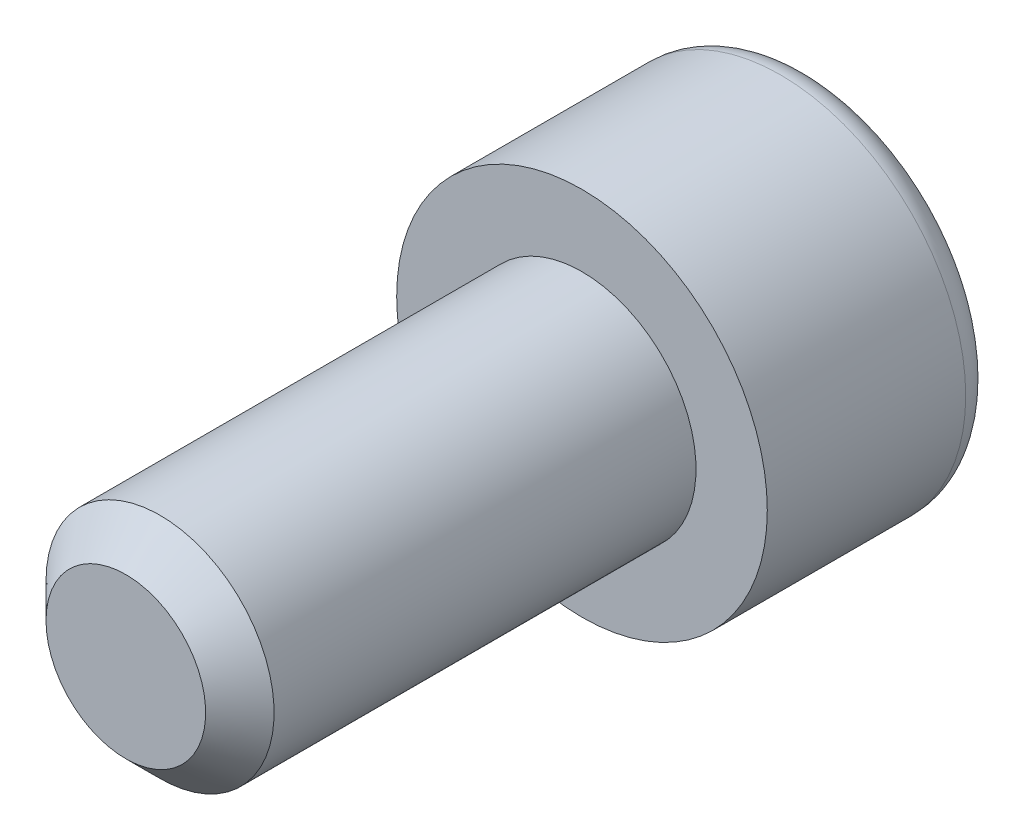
ISO-10303-21;
HEADER;
FILE_DESCRIPTION(('STEP AP214'),'2;1');
FILE_NAME('part.step','',(''),(''),'','','');
FILE_SCHEMA(('AUTOMOTIVE_DESIGN { 1 0 10303 214 1 1 1 1 }'));
ENDSEC;
DATA;
#1=APPLICATION_CONTEXT('core data for automotive mechanical design processes');
#2=APPLICATION_PROTOCOL_DEFINITION('international standard','automotive_design',2000,#1);
#3=PRODUCT_CONTEXT('',#1,'mechanical');
#4=PRODUCT('Part','Part','',(#3));
#5=PRODUCT_RELATED_PRODUCT_CATEGORY('part','',(#4));
#6=PRODUCT_DEFINITION_FORMATION('','',#4);
#7=PRODUCT_DEFINITION_CONTEXT('part definition',#1,'design');
#8=PRODUCT_DEFINITION('design','',#6,#7);
#9=PRODUCT_DEFINITION_SHAPE('','',#8);
#10=(LENGTH_UNIT() NAMED_UNIT(*) SI_UNIT(.MILLI.,.METRE.));
#11=(NAMED_UNIT(*) PLANE_ANGLE_UNIT() SI_UNIT($,.RADIAN.));
#12=(NAMED_UNIT(*) SI_UNIT($,.STERADIAN.) SOLID_ANGLE_UNIT());
#13=UNCERTAINTY_MEASURE_WITH_UNIT(LENGTH_MEASURE(1.E-05),#10,'distance_accuracy_value','');
#14=(GEOMETRIC_REPRESENTATION_CONTEXT(3) GLOBAL_UNCERTAINTY_ASSIGNED_CONTEXT((#13)) GLOBAL_UNIT_ASSIGNED_CONTEXT((#10,
#11,#12)) REPRESENTATION_CONTEXT('',''));
#15=CARTESIAN_POINT('',(0.,0.,0.));
#16=DIRECTION('',(0.,0.,1.));
#17=DIRECTION('',(1.,0.,0.));
#18=AXIS2_PLACEMENT_3D('',#15,#16,#17);
#19=CARTESIAN_POINT('',(0.,0.,-7.99999999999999));
#20=DIRECTION('',(0.,0.,1.));
#21=DIRECTION('',(1.,0.,0.));
#22=AXIS2_PLACEMENT_3D('',#19,#20,#21);
#23=PLANE('',#22);
#24=CARTESIAN_POINT('',(0.,0.,-7.99999999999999));
#25=DIRECTION('',(0.,0.,1.));
#26=DIRECTION('',(1.,0.,0.));
#27=AXIS2_PLACEMENT_3D('',#24,#25,#26);
#28=CIRCLE('',#27,5.46);
#29=CARTESIAN_POINT('',(5.46000000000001,0.,-7.99999999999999));
#30=VERTEX_POINT('',#29);
#31=EDGE_CURVE('E11',#30,#30,#28,.F.);
#32=ORIENTED_EDGE('',*,*,#31,.T.);
#33=EDGE_LOOP('',(#32));
#34=FACE_BOUND('',#33,.T.);
#35=DIRECTION('',(0.86602540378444,-0.5,0.));
#36=VECTOR('',#35,1.);
#37=CARTESIAN_POINT('',(-2.99999999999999,-1.73205080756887,-7.99999999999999));
#38=LINE('',#37,#36);
#39=CARTESIAN_POINT('',(-2.99999999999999,-1.73205080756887,-7.99999999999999));
#40=VERTEX_POINT('',#39);
#41=CARTESIAN_POINT('',(0.,-3.46410161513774,-7.99999999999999));
#42=VERTEX_POINT('',#41);
#43=EDGE_CURVE('E47',#40,#42,#38,.T.);
#44=ORIENTED_EDGE('',*,*,#43,.T.);
#45=DIRECTION('',(0.86602540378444,0.500000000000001,0.));
#46=VECTOR('',#45,1.);
#47=CARTESIAN_POINT('',(0.,-3.46410161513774,-7.99999999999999));
#48=LINE('',#47,#46);
#49=CARTESIAN_POINT('',(3.00000000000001,-1.73205080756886,-7.99999999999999));
#50=VERTEX_POINT('',#49);
#51=EDGE_CURVE('E87',#42,#50,#48,.T.);
#52=ORIENTED_EDGE('',*,*,#51,.T.);
#53=DIRECTION('',(0.,1.,0.));
#54=VECTOR('',#53,1.);
#55=CARTESIAN_POINT('',(3.00000000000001,-1.73205080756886,-7.99999999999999));
#56=LINE('',#55,#54);
#57=CARTESIAN_POINT('',(3.00000000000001,1.73205080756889,-7.99999999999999));
#58=VERTEX_POINT('',#57);
#59=EDGE_CURVE('E95',#50,#58,#56,.T.);
#60=ORIENTED_EDGE('',*,*,#59,.T.);
#61=DIRECTION('',(-0.86602540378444,0.5,0.));
#62=VECTOR('',#61,1.);
#63=CARTESIAN_POINT('',(3.00000000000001,1.73205080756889,-7.99999999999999));
#64=LINE('',#63,#62);
#65=CARTESIAN_POINT('',(0.,3.46410161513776,-7.99999999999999));
#66=VERTEX_POINT('',#65);
#67=EDGE_CURVE('E110',#58,#66,#64,.T.);
#68=ORIENTED_EDGE('',*,*,#67,.T.);
#69=DIRECTION('',(-0.86602540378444,-0.500000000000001,0.));
#70=VECTOR('',#69,1.);
#71=CARTESIAN_POINT('',(0.,3.46410161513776,-7.99999999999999));
#72=LINE('',#71,#70);
#73=CARTESIAN_POINT('',(-2.99999999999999,1.73205080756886,-7.99999999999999));
#74=VERTEX_POINT('',#73);
#75=EDGE_CURVE('E113',#66,#74,#72,.T.);
#76=ORIENTED_EDGE('',*,*,#75,.T.);
#77=DIRECTION('',(0.,-1.,0.));
#78=VECTOR('',#77,1.);
#79=CARTESIAN_POINT('',(-2.99999999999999,1.73205080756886,-7.99999999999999));
#80=LINE('',#79,#78);
#81=EDGE_CURVE('E106',#74,#40,#80,.T.);
#82=ORIENTED_EDGE('',*,*,#81,.T.);
#83=EDGE_LOOP('',(#44,#52,#60,#68,#76,#82));
#84=FACE_BOUND('',#83,.T.);
#85=ADVANCED_FACE('F32',(#34,#84),#23,.F.);
#86=CARTESIAN_POINT('',(0.,0.,16.));
#87=DIRECTION('',(0.,0.,-1.));
#88=DIRECTION('',(-1.,0.,0.));
#89=AXIS2_PLACEMENT_3D('',#86,#87,#88);
#90=CYLINDRICAL_SURFACE('',#89,4.);
#91=CARTESIAN_POINT('',(0.,0.,14.8));
#92=DIRECTION('',(0.,0.,0.999999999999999));
#93=DIRECTION('',(1.,0.,0.));
#94=AXIS2_PLACEMENT_3D('',#91,#92,#93);
#95=CIRCLE('',#94,4.);
#96=CARTESIAN_POINT('',(-4.00000000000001,0.,14.8));
#97=VERTEX_POINT('',#96);
#98=EDGE_CURVE('E143',#97,#97,#95,.F.);
#99=CARTESIAN_POINT('',(0.,0.,0.));
#100=DIRECTION('',(0.,0.,1.));
#101=DIRECTION('',(1.,0.,0.));
#102=AXIS2_PLACEMENT_3D('',#99,#100,#101);
#103=CIRCLE('',#102,4.);
#104=CARTESIAN_POINT('',(-4.00000000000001,0.,0.));
#105=VERTEX_POINT('',#104);
#106=EDGE_CURVE('E137',#105,#105,#103,.T.);
#107=CARTESIAN_POINT('',(-4.00000000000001,0.,14.8));
#108=CARTESIAN_POINT('',(-4.00000000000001,0.,14.6458333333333));
#109=CARTESIAN_POINT('',(-4.00000000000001,0.,14.4916666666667));
#110=CARTESIAN_POINT('',(-4.00000000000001,0.,14.1833333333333));
#111=CARTESIAN_POINT('',(-4.00000000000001,0.,14.0291666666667));
#112=CARTESIAN_POINT('',(-4.00000000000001,0.,13.7208333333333));
#113=CARTESIAN_POINT('',(-4.00000000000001,0.,13.5666666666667));
#114=CARTESIAN_POINT('',(-4.00000000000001,0.,13.2583333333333));
#115=CARTESIAN_POINT('',(-4.00000000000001,0.,13.1041666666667));
#116=CARTESIAN_POINT('',(-4.00000000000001,0.,12.7958333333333));
#117=CARTESIAN_POINT('',(-4.00000000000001,0.,12.6416666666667));
#118=CARTESIAN_POINT('',(-4.00000000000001,0.,12.3333333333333));
#119=CARTESIAN_POINT('',(-4.00000000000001,0.,12.1791666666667));
#120=CARTESIAN_POINT('',(-4.00000000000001,0.,11.8708333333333));
#121=CARTESIAN_POINT('',(-4.00000000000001,0.,11.7166666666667));
#122=CARTESIAN_POINT('',(-4.00000000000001,0.,11.4083333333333));
#123=CARTESIAN_POINT('',(-4.00000000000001,0.,11.2541666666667));
#124=CARTESIAN_POINT('',(-4.00000000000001,0.,10.9458333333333));
#125=CARTESIAN_POINT('',(-4.00000000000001,0.,10.7916666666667));
#126=CARTESIAN_POINT('',(-4.00000000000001,0.,10.4833333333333));
#127=CARTESIAN_POINT('',(-4.00000000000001,0.,10.3291666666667));
#128=CARTESIAN_POINT('',(-4.00000000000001,0.,10.0208333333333));
#129=CARTESIAN_POINT('',(-4.00000000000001,0.,9.86666666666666));
#130=CARTESIAN_POINT('',(-4.00000000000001,0.,9.55833333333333));
#131=CARTESIAN_POINT('',(-4.00000000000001,0.,9.40416666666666));
#132=CARTESIAN_POINT('',(-4.00000000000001,0.,9.09583333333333));
#133=CARTESIAN_POINT('',(-4.00000000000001,0.,8.94166666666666));
#134=CARTESIAN_POINT('',(-4.00000000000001,0.,8.63333333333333));
#135=CARTESIAN_POINT('',(-4.00000000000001,0.,8.47916666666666));
#136=CARTESIAN_POINT('',(-4.00000000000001,0.,8.17083333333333));
#137=CARTESIAN_POINT('',(-4.00000000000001,0.,8.01666666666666));
#138=CARTESIAN_POINT('',(-4.00000000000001,0.,7.70833333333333));
#139=CARTESIAN_POINT('',(-4.00000000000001,0.,7.55416666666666));
#140=CARTESIAN_POINT('',(-4.00000000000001,0.,7.24583333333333));
#141=CARTESIAN_POINT('',(-4.00000000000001,0.,7.09166666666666));
#142=CARTESIAN_POINT('',(-4.00000000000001,0.,6.78333333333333));
#143=CARTESIAN_POINT('',(-4.00000000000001,0.,6.62916666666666));
#144=CARTESIAN_POINT('',(-4.00000000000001,0.,6.32083333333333));
#145=CARTESIAN_POINT('',(-4.00000000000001,0.,6.16666666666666));
#146=CARTESIAN_POINT('',(-4.00000000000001,0.,5.85833333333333));
#147=CARTESIAN_POINT('',(-4.00000000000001,0.,5.70416666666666));
#148=CARTESIAN_POINT('',(-4.00000000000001,0.,5.39583333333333));
#149=CARTESIAN_POINT('',(-4.00000000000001,0.,5.24166666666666));
#150=CARTESIAN_POINT('',(-4.00000000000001,0.,4.93333333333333));
#151=CARTESIAN_POINT('',(-4.00000000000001,0.,4.77916666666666));
#152=CARTESIAN_POINT('',(-4.00000000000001,0.,4.47083333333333));
#153=CARTESIAN_POINT('',(-4.00000000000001,0.,4.31666666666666));
#154=CARTESIAN_POINT('',(-4.00000000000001,0.,4.00833333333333));
#155=CARTESIAN_POINT('',(-4.00000000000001,0.,3.85416666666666));
#156=CARTESIAN_POINT('',(-4.00000000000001,0.,3.54583333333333));
#157=CARTESIAN_POINT('',(-4.00000000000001,0.,3.39166666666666));
#158=CARTESIAN_POINT('',(-4.00000000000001,0.,3.08333333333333));
#159=CARTESIAN_POINT('',(-4.00000000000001,0.,2.92916666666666));
#160=CARTESIAN_POINT('',(-4.00000000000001,0.,2.62083333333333));
#161=CARTESIAN_POINT('',(-4.00000000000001,0.,2.46666666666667));
#162=CARTESIAN_POINT('',(-4.00000000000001,0.,2.15833333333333));
#163=CARTESIAN_POINT('',(-4.00000000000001,0.,2.00416666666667));
#164=CARTESIAN_POINT('',(-4.00000000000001,0.,1.69583333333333));
#165=CARTESIAN_POINT('',(-4.00000000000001,0.,1.54166666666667));
#166=CARTESIAN_POINT('',(-4.00000000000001,0.,1.23333333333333));
#167=CARTESIAN_POINT('',(-4.00000000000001,0.,1.07916666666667));
#168=CARTESIAN_POINT('',(-4.00000000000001,0.,0.770833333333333));
#169=CARTESIAN_POINT('',(-4.00000000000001,0.,0.616666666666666));
#170=CARTESIAN_POINT('',(-4.00000000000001,0.,0.308333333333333));
#171=CARTESIAN_POINT('',(-4.00000000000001,0.,0.154166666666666));
#172=CARTESIAN_POINT('',(-4.00000000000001,0.,0.));
#173=B_SPLINE_CURVE_WITH_KNOTS('',3,(#107,#108,#109,#110,#111,#112,#113,#114,#115,#116,#117,
#118,#119,#120,#121,#122,#123,#124,#125,#126,#127,#128,#129,#130,#131,#132,#133,#134,#135,#136,
#137,#138,#139,#140,#141,#142,#143,#144,#145,#146,#147,#148,#149,#150,#151,#152,#153,#154,#155,
#156,#157,#158,#159,#160,#161,#162,#163,#164,#165,#166,#167,#168,#169,#170,#171,#172),
.UNSPECIFIED.,.F.,.F.,(4,2,2,2,2,2,2,2,2,2,2,2,2,2,2,2,2,2,2,2,2,2,2,2,2,2,2,2,2,2,2,2,4),(0.,
0.462499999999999,0.924999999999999,1.3875,1.85,2.3125,2.775,3.2375,3.69999999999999,4.1625,
4.625,5.0875,5.55,6.01249999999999,6.47499999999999,6.93749999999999,7.4,7.86249999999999,8.325,
8.78749999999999,9.24999999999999,9.71249999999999,10.175,10.6375,11.1,11.5625,12.025,12.4875,
12.95,13.4125,13.875,14.3375,14.8),.UNSPECIFIED.);
#174=EDGE_CURVE('BSEAM34',#97,#105,#173,.T.);
#175=ORIENTED_EDGE('',*,*,#98,.T.);
#176=ORIENTED_EDGE('',*,*,#106,.T.);
#177=ORIENTED_EDGE('',*,*,#174,.T.);
#178=ORIENTED_EDGE('',*,*,#174,.F.);
#179=EDGE_LOOP('',(#175,#177,#176,#178));
#180=FACE_BOUND('',#179,.T.);
#181=ADVANCED_FACE('F34',(#180),#90,.T.);
#182=CARTESIAN_POINT('',(0.,0.,16.));
#183=DIRECTION('',(0.,0.,1.));
#184=DIRECTION('',(1.,0.,0.));
#185=AXIS2_PLACEMENT_3D('',#182,#183,#184);
#186=PLANE('',#185);
#187=CARTESIAN_POINT('',(0.,0.,16.));
#188=DIRECTION('',(0.,0.,1.));
#189=DIRECTION('',(1.,0.,0.));
#190=AXIS2_PLACEMENT_3D('',#187,#188,#189);
#191=CIRCLE('',#190,2.8);
#192=CARTESIAN_POINT('',(-2.80000000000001,0.,16.));
#193=VERTEX_POINT('',#192);
#194=EDGE_CURVE('E140',#193,#193,#191,.T.);
#195=ORIENTED_EDGE('',*,*,#194,.T.);
#196=EDGE_LOOP('',(#195));
#197=FACE_BOUND('',#196,.T.);
#198=ADVANCED_FACE('F169',(#197),#186,.T.);
#199=CARTESIAN_POINT('',(0.,0.,0.));
#200=DIRECTION('',(0.,0.,1.));
#201=DIRECTION('',(1.,0.,0.));
#202=AXIS2_PLACEMENT_3D('',#199,#200,#201);
#203=PLANE('',#202);
#204=CARTESIAN_POINT('',(0.,0.,0.));
#205=DIRECTION('',(0.,0.,1.));
#206=DIRECTION('',(1.,0.,0.));
#207=AXIS2_PLACEMENT_3D('',#204,#205,#206);
#208=CIRCLE('',#207,6.5);
#209=CARTESIAN_POINT('',(6.50000000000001,0.,0.));
#210=VERTEX_POINT('',#209);
#211=EDGE_CURVE('E101',#210,#210,#208,.T.);
#212=ORIENTED_EDGE('',*,*,#211,.T.);
#213=EDGE_LOOP('',(#212));
#214=FACE_BOUND('',#213,.T.);
#215=ORIENTED_EDGE('',*,*,#106,.F.);
#216=EDGE_LOOP('',(#215));
#217=FACE_BOUND('',#216,.T.);
#218=ADVANCED_FACE('F173',(#214,#217),#203,.T.);
#219=CARTESIAN_POINT('',(0.,0.,-7.99999999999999));
#220=DIRECTION('',(0.,0.,1.));
#221=DIRECTION('',(1.,0.,0.));
#222=AXIS2_PLACEMENT_3D('',#219,#220,#221);
#223=CYLINDRICAL_SURFACE('',#222,6.5);
#224=CARTESIAN_POINT('',(0.,0.,-6.96));
#225=DIRECTION('',(0.,0.,1.));
#226=DIRECTION('',(1.,0.,0.));
#227=AXIS2_PLACEMENT_3D('',#224,#225,#226);
#228=CIRCLE('',#227,6.5);
#229=CARTESIAN_POINT('',(6.50000000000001,0.,-6.96));
#230=VERTEX_POINT('',#229);
#231=EDGE_CURVE('E40',#230,#230,#228,.T.);
#232=CARTESIAN_POINT('',(6.50000000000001,0.,-6.96));
#233=CARTESIAN_POINT('',(6.50000000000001,0.,-6.8875));
#234=CARTESIAN_POINT('',(6.50000000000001,0.,-6.815));
#235=CARTESIAN_POINT('',(6.50000000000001,0.,-6.67));
#236=CARTESIAN_POINT('',(6.50000000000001,0.,-6.5975));
#237=CARTESIAN_POINT('',(6.50000000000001,0.,-6.4525));
#238=CARTESIAN_POINT('',(6.50000000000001,0.,-6.38));
#239=CARTESIAN_POINT('',(6.50000000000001,0.,-6.235));
#240=CARTESIAN_POINT('',(6.50000000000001,0.,-6.1625));
#241=CARTESIAN_POINT('',(6.50000000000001,0.,-6.0175));
#242=CARTESIAN_POINT('',(6.50000000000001,0.,-5.945));
#243=CARTESIAN_POINT('',(6.50000000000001,0.,-5.8));
#244=CARTESIAN_POINT('',(6.50000000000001,0.,-5.7275));
#245=CARTESIAN_POINT('',(6.50000000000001,0.,-5.5825));
#246=CARTESIAN_POINT('',(6.50000000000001,0.,-5.51));
#247=CARTESIAN_POINT('',(6.50000000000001,0.,-5.365));
#248=CARTESIAN_POINT('',(6.50000000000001,0.,-5.2925));
#249=CARTESIAN_POINT('',(6.50000000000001,0.,-5.1475));
#250=CARTESIAN_POINT('',(6.50000000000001,0.,-5.075));
#251=CARTESIAN_POINT('',(6.50000000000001,0.,-4.93));
#252=CARTESIAN_POINT('',(6.50000000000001,0.,-4.8575));
#253=CARTESIAN_POINT('',(6.50000000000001,0.,-4.7125));
#254=CARTESIAN_POINT('',(6.50000000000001,0.,-4.64));
#255=CARTESIAN_POINT('',(6.50000000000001,0.,-4.495));
#256=CARTESIAN_POINT('',(6.50000000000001,0.,-4.4225));
#257=CARTESIAN_POINT('',(6.50000000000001,0.,-4.2775));
#258=CARTESIAN_POINT('',(6.50000000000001,0.,-4.205));
#259=CARTESIAN_POINT('',(6.50000000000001,0.,-4.06));
#260=CARTESIAN_POINT('',(6.50000000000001,0.,-3.9875));
#261=CARTESIAN_POINT('',(6.50000000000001,0.,-3.8425));
#262=CARTESIAN_POINT('',(6.50000000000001,0.,-3.77));
#263=CARTESIAN_POINT('',(6.50000000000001,0.,-3.625));
#264=CARTESIAN_POINT('',(6.50000000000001,0.,-3.5525));
#265=CARTESIAN_POINT('',(6.50000000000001,0.,-3.4075));
#266=CARTESIAN_POINT('',(6.50000000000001,0.,-3.335));
#267=CARTESIAN_POINT('',(6.50000000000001,0.,-3.19));
#268=CARTESIAN_POINT('',(6.50000000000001,0.,-3.1175));
#269=CARTESIAN_POINT('',(6.50000000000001,0.,-2.9725));
#270=CARTESIAN_POINT('',(6.50000000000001,0.,-2.9));
#271=CARTESIAN_POINT('',(6.50000000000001,0.,-2.755));
#272=CARTESIAN_POINT('',(6.50000000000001,0.,-2.6825));
#273=CARTESIAN_POINT('',(6.50000000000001,0.,-2.5375));
#274=CARTESIAN_POINT('',(6.50000000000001,0.,-2.465));
#275=CARTESIAN_POINT('',(6.50000000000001,0.,-2.32));
#276=CARTESIAN_POINT('',(6.50000000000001,0.,-2.2475));
#277=CARTESIAN_POINT('',(6.50000000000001,0.,-2.1025));
#278=CARTESIAN_POINT('',(6.50000000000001,0.,-2.03));
#279=CARTESIAN_POINT('',(6.50000000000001,0.,-1.885));
#280=CARTESIAN_POINT('',(6.50000000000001,0.,-1.8125));
#281=CARTESIAN_POINT('',(6.50000000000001,0.,-1.6675));
#282=CARTESIAN_POINT('',(6.50000000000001,0.,-1.595));
#283=CARTESIAN_POINT('',(6.50000000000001,0.,-1.45));
#284=CARTESIAN_POINT('',(6.50000000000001,0.,-1.3775));
#285=CARTESIAN_POINT('',(6.50000000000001,0.,-1.2325));
#286=CARTESIAN_POINT('',(6.50000000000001,0.,-1.16));
#287=CARTESIAN_POINT('',(6.50000000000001,0.,-1.015));
#288=CARTESIAN_POINT('',(6.50000000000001,0.,-0.9425));
#289=CARTESIAN_POINT('',(6.50000000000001,0.,-0.7975));
#290=CARTESIAN_POINT('',(6.50000000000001,0.,-0.725));
#291=CARTESIAN_POINT('',(6.50000000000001,0.,-0.58));
#292=CARTESIAN_POINT('',(6.50000000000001,0.,-0.5075));
#293=CARTESIAN_POINT('',(6.50000000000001,0.,-0.3625));
#294=CARTESIAN_POINT('',(6.50000000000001,0.,-0.29));
#295=CARTESIAN_POINT('',(6.50000000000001,0.,-0.145));
#296=CARTESIAN_POINT('',(6.50000000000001,0.,-0.0724999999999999));
#297=CARTESIAN_POINT('',(6.50000000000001,0.,0.));
#298=B_SPLINE_CURVE_WITH_KNOTS('',3,(#232,#233,#234,#235,#236,#237,#238,#239,#240,#241,#242,
#243,#244,#245,#246,#247,#248,#249,#250,#251,#252,#253,#254,#255,#256,#257,#258,#259,#260,#261,
#262,#263,#264,#265,#266,#267,#268,#269,#270,#271,#272,#273,#274,#275,#276,#277,#278,#279,#280,
#281,#282,#283,#284,#285,#286,#287,#288,#289,#290,#291,#292,#293,#294,#295,#296,#297),
.UNSPECIFIED.,.F.,.F.,(4,2,2,2,2,2,2,2,2,2,2,2,2,2,2,2,2,2,2,2,2,2,2,2,2,2,2,2,2,2,2,2,4),(0.,
0.217500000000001,0.435,0.6525,0.87,1.0875,1.305,1.5225,1.74,1.9575,2.175,2.3925,2.61,2.8275,
3.045,3.2625,3.48,3.6975,3.915,4.1325,4.35,4.5675,4.785,5.0025,5.22,5.4375,5.655,5.8725,6.09,
6.3075,6.525,6.7425,6.96),.UNSPECIFIED.);
#299=EDGE_CURVE('BSEAM148',#230,#210,#298,.T.);
#300=ORIENTED_EDGE('',*,*,#231,.T.);
#301=ORIENTED_EDGE('',*,*,#211,.F.);
#302=ORIENTED_EDGE('',*,*,#299,.T.);
#303=ORIENTED_EDGE('',*,*,#299,.F.);
#304=EDGE_LOOP('',(#300,#302,#301,#303));
#305=FACE_BOUND('',#304,.T.);
#306=ADVANCED_FACE('F148',(#305),#223,.T.);
#307=CARTESIAN_POINT('',(-2.99999999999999,-1.73205080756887,-2.4));
#308=DIRECTION('',(0.500000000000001,0.86602540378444,0.));
#309=DIRECTION('',(-0.86602540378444,0.5,0.));
#310=AXIS2_PLACEMENT_3D('',#307,#308,#309);
#311=PLANE('',#310);
#312=ORIENTED_EDGE('',*,*,#43,.F.);
#313=DIRECTION('',(0.,0.,-1.));
#314=VECTOR('',#313,1.);
#315=CARTESIAN_POINT('',(-2.99999999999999,-1.73205080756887,-2.4));
#316=LINE('',#315,#314);
#317=CARTESIAN_POINT('',(-2.99999999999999,-1.73205080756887,-2.4));
#318=VERTEX_POINT('',#317);
#319=EDGE_CURVE('E126',#318,#40,#316,.T.);
#320=ORIENTED_EDGE('',*,*,#319,.F.);
#321=DIRECTION('',(0.86602540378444,-0.5,0.));
#322=VECTOR('',#321,1.);
#323=CARTESIAN_POINT('',(-2.99999999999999,-1.73205080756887,-2.4));
#324=LINE('',#323,#322);
#325=CARTESIAN_POINT('',(0.,-3.46410161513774,-2.4));
#326=VERTEX_POINT('',#325);
#327=EDGE_CURVE('E100',#318,#326,#324,.T.);
#328=ORIENTED_EDGE('',*,*,#327,.T.);
#329=DIRECTION('',(0.,0.,-1.));
#330=VECTOR('',#329,1.);
#331=CARTESIAN_POINT('',(0.,-3.46410161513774,-2.4));
#332=LINE('',#331,#330);
#333=EDGE_CURVE('E89',#326,#42,#332,.T.);
#334=ORIENTED_EDGE('',*,*,#333,.T.);
#335=EDGE_LOOP('',(#312,#320,#328,#334));
#336=FACE_BOUND('',#335,.T.);
#337=ADVANCED_FACE('F98',(#336),#311,.T.);
#338=CARTESIAN_POINT('',(0.,-3.46410161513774,-2.4));
#339=DIRECTION('',(-0.5,0.866025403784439,0.));
#340=DIRECTION('',(-0.86602540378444,-0.500000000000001,0.));
#341=AXIS2_PLACEMENT_3D('',#338,#339,#340);
#342=PLANE('',#341);
#343=ORIENTED_EDGE('',*,*,#51,.F.);
#344=ORIENTED_EDGE('',*,*,#333,.F.);
#345=DIRECTION('',(0.86602540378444,0.500000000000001,0.));
#346=VECTOR('',#345,1.);
#347=CARTESIAN_POINT('',(0.,-3.46410161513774,-2.4));
#348=LINE('',#347,#346);
#349=CARTESIAN_POINT('',(3.00000000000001,-1.73205080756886,-2.4));
#350=VERTEX_POINT('',#349);
#351=EDGE_CURVE('E117',#326,#350,#348,.T.);
#352=ORIENTED_EDGE('',*,*,#351,.T.);
#353=DIRECTION('',(0.,0.,-1.));
#354=VECTOR('',#353,1.);
#355=CARTESIAN_POINT('',(3.00000000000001,-1.73205080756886,-2.4));
#356=LINE('',#355,#354);
#357=EDGE_CURVE('E91',#350,#50,#356,.T.);
#358=ORIENTED_EDGE('',*,*,#357,.T.);
#359=EDGE_LOOP('',(#343,#344,#352,#358));
#360=FACE_BOUND('',#359,.T.);
#361=ADVANCED_FACE('F88',(#360),#342,.T.);
#362=CARTESIAN_POINT('',(3.00000000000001,-1.73205080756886,-2.4));
#363=DIRECTION('',(-1.,0.,0.));
#364=DIRECTION('',(0.,0.,1.));
#365=AXIS2_PLACEMENT_3D('',#362,#363,#364);
#366=PLANE('',#365);
#367=ORIENTED_EDGE('',*,*,#59,.F.);
#368=ORIENTED_EDGE('',*,*,#357,.F.);
#369=DIRECTION('',(0.,1.,0.));
#370=VECTOR('',#369,1.);
#371=CARTESIAN_POINT('',(3.00000000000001,-1.73205080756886,-2.4));
#372=LINE('',#371,#370);
#373=CARTESIAN_POINT('',(3.00000000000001,1.73205080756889,-2.4));
#374=VERTEX_POINT('',#373);
#375=EDGE_CURVE('E119',#350,#374,#372,.T.);
#376=ORIENTED_EDGE('',*,*,#375,.T.);
#377=DIRECTION('',(0.,0.,-1.));
#378=VECTOR('',#377,1.);
#379=CARTESIAN_POINT('',(3.00000000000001,1.73205080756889,-2.4));
#380=LINE('',#379,#378);
#381=EDGE_CURVE('E132',#374,#58,#380,.T.);
#382=ORIENTED_EDGE('',*,*,#381,.T.);
#383=EDGE_LOOP('',(#367,#368,#376,#382));
#384=FACE_BOUND('',#383,.T.);
#385=ADVANCED_FACE('F205',(#384),#366,.T.);
#386=CARTESIAN_POINT('',(3.00000000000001,1.73205080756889,-2.4));
#387=DIRECTION('',(-0.500000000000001,-0.86602540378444,0.));
#388=DIRECTION('',(0.86602540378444,-0.5,0.));
#389=AXIS2_PLACEMENT_3D('',#386,#387,#388);
#390=PLANE('',#389);
#391=ORIENTED_EDGE('',*,*,#67,.F.);
#392=ORIENTED_EDGE('',*,*,#381,.F.);
#393=DIRECTION('',(-0.86602540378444,0.5,0.));
#394=VECTOR('',#393,1.);
#395=CARTESIAN_POINT('',(3.00000000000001,1.73205080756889,-2.4));
#396=LINE('',#395,#394);
#397=CARTESIAN_POINT('',(0.,3.46410161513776,-2.4));
#398=VERTEX_POINT('',#397);
#399=EDGE_CURVE('E121',#374,#398,#396,.T.);
#400=ORIENTED_EDGE('',*,*,#399,.T.);
#401=DIRECTION('',(0.,0.,-1.));
#402=VECTOR('',#401,1.);
#403=CARTESIAN_POINT('',(0.,3.46410161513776,-2.4));
#404=LINE('',#403,#402);
#405=EDGE_CURVE('E130',#398,#66,#404,.T.);
#406=ORIENTED_EDGE('',*,*,#405,.T.);
#407=EDGE_LOOP('',(#391,#392,#400,#406));
#408=FACE_BOUND('',#407,.T.);
#409=ADVANCED_FACE('F212',(#408),#390,.T.);
#410=CARTESIAN_POINT('',(0.,3.46410161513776,-2.4));
#411=DIRECTION('',(0.5,-0.866025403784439,0.));
#412=DIRECTION('',(0.86602540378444,0.500000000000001,0.));
#413=AXIS2_PLACEMENT_3D('',#410,#411,#412);
#414=PLANE('',#413);
#415=ORIENTED_EDGE('',*,*,#75,.F.);
#416=ORIENTED_EDGE('',*,*,#405,.F.);
#417=DIRECTION('',(-0.86602540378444,-0.500000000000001,0.));
#418=VECTOR('',#417,1.);
#419=CARTESIAN_POINT('',(0.,3.46410161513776,-2.4));
#420=LINE('',#419,#418);
#421=CARTESIAN_POINT('',(-2.99999999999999,1.73205080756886,-2.4));
#422=VERTEX_POINT('',#421);
#423=EDGE_CURVE('E123',#398,#422,#420,.T.);
#424=ORIENTED_EDGE('',*,*,#423,.T.);
#425=DIRECTION('',(0.,0.,-1.));
#426=VECTOR('',#425,1.);
#427=CARTESIAN_POINT('',(-2.99999999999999,1.73205080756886,-2.4));
#428=LINE('',#427,#426);
#429=EDGE_CURVE('E128',#422,#74,#428,.T.);
#430=ORIENTED_EDGE('',*,*,#429,.T.);
#431=EDGE_LOOP('',(#415,#416,#424,#430));
#432=FACE_BOUND('',#431,.T.);
#433=ADVANCED_FACE('F220',(#432),#414,.T.);
#434=CARTESIAN_POINT('',(-2.99999999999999,1.73205080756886,-2.4));
#435=DIRECTION('',(1.,0.,0.));
#436=DIRECTION('',(0.,1.,0.));
#437=AXIS2_PLACEMENT_3D('',#434,#435,#436);
#438=PLANE('',#437);
#439=ORIENTED_EDGE('',*,*,#81,.F.);
#440=ORIENTED_EDGE('',*,*,#429,.F.);
#441=DIRECTION('',(0.,-1.,0.));
#442=VECTOR('',#441,1.);
#443=CARTESIAN_POINT('',(-2.99999999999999,1.73205080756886,-2.4));
#444=LINE('',#443,#442);
#445=EDGE_CURVE('E54',#422,#318,#444,.T.);
#446=ORIENTED_EDGE('',*,*,#445,.T.);
#447=ORIENTED_EDGE('',*,*,#319,.T.);
#448=EDGE_LOOP('',(#439,#440,#446,#447));
#449=FACE_BOUND('',#448,.T.);
#450=ADVANCED_FACE('F228',(#449),#438,.T.);
#451=CARTESIAN_POINT('',(-2.99999999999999,-1.73205080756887,-2.4));
#452=DIRECTION('',(0.,0.,-1.));
#453=DIRECTION('',(-1.,0.,0.));
#454=AXIS2_PLACEMENT_3D('',#451,#452,#453);
#455=PLANE('',#454);
#456=ORIENTED_EDGE('',*,*,#327,.F.);
#457=ORIENTED_EDGE('',*,*,#445,.F.);
#458=ORIENTED_EDGE('',*,*,#423,.F.);
#459=ORIENTED_EDGE('',*,*,#399,.F.);
#460=ORIENTED_EDGE('',*,*,#375,.F.);
#461=ORIENTED_EDGE('',*,*,#351,.F.);
#462=EDGE_LOOP('',(#456,#457,#458,#459,#460,#461));
#463=FACE_BOUND('',#462,.T.);
#464=ADVANCED_FACE('F159',(#463),#455,.T.);
#465=CARTESIAN_POINT('',(0.,0.,16.));
#466=DIRECTION('',(0.,0.,-0.999999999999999));
#467=DIRECTION('',(-1.,0.,0.));
#468=AXIS2_PLACEMENT_3D('',#465,#466,#467);
#469=CONICAL_SURFACE('',#468,2.8,0.785398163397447);
#470=CARTESIAN_POINT('',(-4.,0.,14.8));
#471=CARTESIAN_POINT('',(-3.9875,0.,14.8125));
#472=CARTESIAN_POINT('',(-3.975,0.,14.825));
#473=CARTESIAN_POINT('',(-3.95,0.,14.85));
#474=CARTESIAN_POINT('',(-3.9375,0.,14.8625));
#475=CARTESIAN_POINT('',(-3.9125,0.,14.8875));
#476=CARTESIAN_POINT('',(-3.9,0.,14.9));
#477=CARTESIAN_POINT('',(-3.875,0.,14.925));
#478=CARTESIAN_POINT('',(-3.8625,0.,14.9375));
#479=CARTESIAN_POINT('',(-3.8375,0.,14.9625));
#480=CARTESIAN_POINT('',(-3.825,0.,14.975));
#481=CARTESIAN_POINT('',(-3.8,0.,15.));
#482=CARTESIAN_POINT('',(-3.7875,0.,15.0125));
#483=CARTESIAN_POINT('',(-3.7625,0.,15.0375));
#484=CARTESIAN_POINT('',(-3.75,0.,15.05));
#485=CARTESIAN_POINT('',(-3.725,0.,15.075));
#486=CARTESIAN_POINT('',(-3.7125,0.,15.0875));
#487=CARTESIAN_POINT('',(-3.6875,0.,15.1125));
#488=CARTESIAN_POINT('',(-3.675,0.,15.125));
#489=CARTESIAN_POINT('',(-3.65,0.,15.15));
#490=CARTESIAN_POINT('',(-3.6375,0.,15.1625));
#491=CARTESIAN_POINT('',(-3.6125,0.,15.1875));
#492=CARTESIAN_POINT('',(-3.6,0.,15.2));
#493=CARTESIAN_POINT('',(-3.575,0.,15.225));
#494=CARTESIAN_POINT('',(-3.5625,0.,15.2375));
#495=CARTESIAN_POINT('',(-3.5375,0.,15.2625));
#496=CARTESIAN_POINT('',(-3.525,0.,15.275));
#497=CARTESIAN_POINT('',(-3.5,0.,15.3));
#498=CARTESIAN_POINT('',(-3.4875,0.,15.3125));
#499=CARTESIAN_POINT('',(-3.4625,0.,15.3375));
#500=CARTESIAN_POINT('',(-3.45,0.,15.35));
#501=CARTESIAN_POINT('',(-3.425,0.,15.375));
#502=CARTESIAN_POINT('',(-3.4125,0.,15.3875));
#503=CARTESIAN_POINT('',(-3.3875,0.,15.4125));
#504=CARTESIAN_POINT('',(-3.375,0.,15.425));
#505=CARTESIAN_POINT('',(-3.35,0.,15.45));
#506=CARTESIAN_POINT('',(-3.3375,0.,15.4625));
#507=CARTESIAN_POINT('',(-3.3125,0.,15.4875));
#508=CARTESIAN_POINT('',(-3.3,0.,15.5));
#509=CARTESIAN_POINT('',(-3.275,0.,15.525));
#510=CARTESIAN_POINT('',(-3.2625,0.,15.5375));
#511=CARTESIAN_POINT('',(-3.2375,0.,15.5625));
#512=CARTESIAN_POINT('',(-3.225,0.,15.575));
#513=CARTESIAN_POINT('',(-3.2,0.,15.6));
#514=CARTESIAN_POINT('',(-3.1875,0.,15.6125));
#515=CARTESIAN_POINT('',(-3.1625,0.,15.6375));
#516=CARTESIAN_POINT('',(-3.15,0.,15.65));
#517=CARTESIAN_POINT('',(-3.125,0.,15.675));
#518=CARTESIAN_POINT('',(-3.1125,0.,15.6875));
#519=CARTESIAN_POINT('',(-3.0875,0.,15.7125));
#520=CARTESIAN_POINT('',(-3.075,0.,15.725));
#521=CARTESIAN_POINT('',(-3.05,0.,15.75));
#522=CARTESIAN_POINT('',(-3.0375,0.,15.7625));
#523=CARTESIAN_POINT('',(-3.0125,0.,15.7875));
#524=CARTESIAN_POINT('',(-3.,0.,15.8));
#525=CARTESIAN_POINT('',(-2.975,0.,15.825));
#526=CARTESIAN_POINT('',(-2.96250000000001,0.,15.8375));
#527=CARTESIAN_POINT('',(-2.93750000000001,0.,15.8625));
#528=CARTESIAN_POINT('',(-2.92500000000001,0.,15.875));
#529=CARTESIAN_POINT('',(-2.90000000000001,0.,15.9));
#530=CARTESIAN_POINT('',(-2.88750000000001,0.,15.9125));
#531=CARTESIAN_POINT('',(-2.86250000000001,0.,15.9375));
#532=CARTESIAN_POINT('',(-2.85000000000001,0.,15.95));
#533=CARTESIAN_POINT('',(-2.82500000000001,0.,15.975));
#534=CARTESIAN_POINT('',(-2.81250000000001,0.,15.9875));
#535=CARTESIAN_POINT('',(-2.80000000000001,0.,16.));
#536=B_SPLINE_CURVE_WITH_KNOTS('',3,(#470,#471,#472,#473,#474,#475,#476,#477,#478,#479,#480,
#481,#482,#483,#484,#485,#486,#487,#488,#489,#490,#491,#492,#493,#494,#495,#496,#497,#498,#499,
#500,#501,#502,#503,#504,#505,#506,#507,#508,#509,#510,#511,#512,#513,#514,#515,#516,#517,#518,
#519,#520,#521,#522,#523,#524,#525,#526,#527,#528,#529,#530,#531,#532,#533,#534,#535),
.UNSPECIFIED.,.F.,.F.,(4,2,2,2,2,2,2,2,2,2,2,2,2,2,2,2,2,2,2,2,2,2,2,2,2,2,2,2,2,2,2,2,4),(0.,
0.0530330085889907,0.106066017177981,0.159099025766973,0.212132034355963,0.265165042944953,
0.318198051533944,0.371231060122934,0.424264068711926,0.477297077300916,0.530330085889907,
0.583363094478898,0.636396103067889,0.689429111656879,0.74246212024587,0.795495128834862,
0.848528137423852,0.901561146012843,0.954594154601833,1.00762716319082,1.06066017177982,
1.11369318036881,1.1667261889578,1.21975919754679,1.27279220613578,1.32582521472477,
1.37885822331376,1.43189123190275,1.48492424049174,1.53795724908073,1.59099025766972,
1.64402326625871,1.69705627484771),.UNSPECIFIED.);
#537=EDGE_CURVE('BSEAM153',#97,#193,#536,.T.);
#538=ORIENTED_EDGE('',*,*,#98,.F.);
#539=ORIENTED_EDGE('',*,*,#194,.F.);
#540=ORIENTED_EDGE('',*,*,#537,.T.);
#541=ORIENTED_EDGE('',*,*,#537,.F.);
#542=EDGE_LOOP('',(#538,#540,#539,#541));
#543=FACE_BOUND('',#542,.T.);
#544=ADVANCED_FACE('F153',(#543),#469,.T.);
#545=CARTESIAN_POINT('',(0.,0.,-6.96));
#546=DIRECTION('',(0.,0.,1.));
#547=DIRECTION('',(1.,0.,0.));
#548=AXIS2_PLACEMENT_3D('',#545,#546,#547);
#549=TOROIDAL_SURFACE('',#548,5.46,1.04);
#550=ORIENTED_EDGE('',*,*,#31,.F.);
#551=EDGE_LOOP('',(#550));
#552=FACE_BOUND('',#551,.T.);
#553=ORIENTED_EDGE('',*,*,#231,.F.);
#554=EDGE_LOOP('',(#553));
#555=FACE_BOUND('',#554,.T.);
#556=ADVANCED_FACE('F151',(#552,#555),#549,.T.);
#557=CLOSED_SHELL('',(#85,#181,#198,#218,#306,#337,#361,#385,#409,#433,#450,#464,#544,#556));
#558=MANIFOLD_SOLID_BREP('B2',#557);
#559=ADVANCED_BREP_SHAPE_REPRESENTATION('',(#18,#558),#14);
#560=SHAPE_DEFINITION_REPRESENTATION(#9,#559);
ENDSEC;
END-ISO-10303-21;
